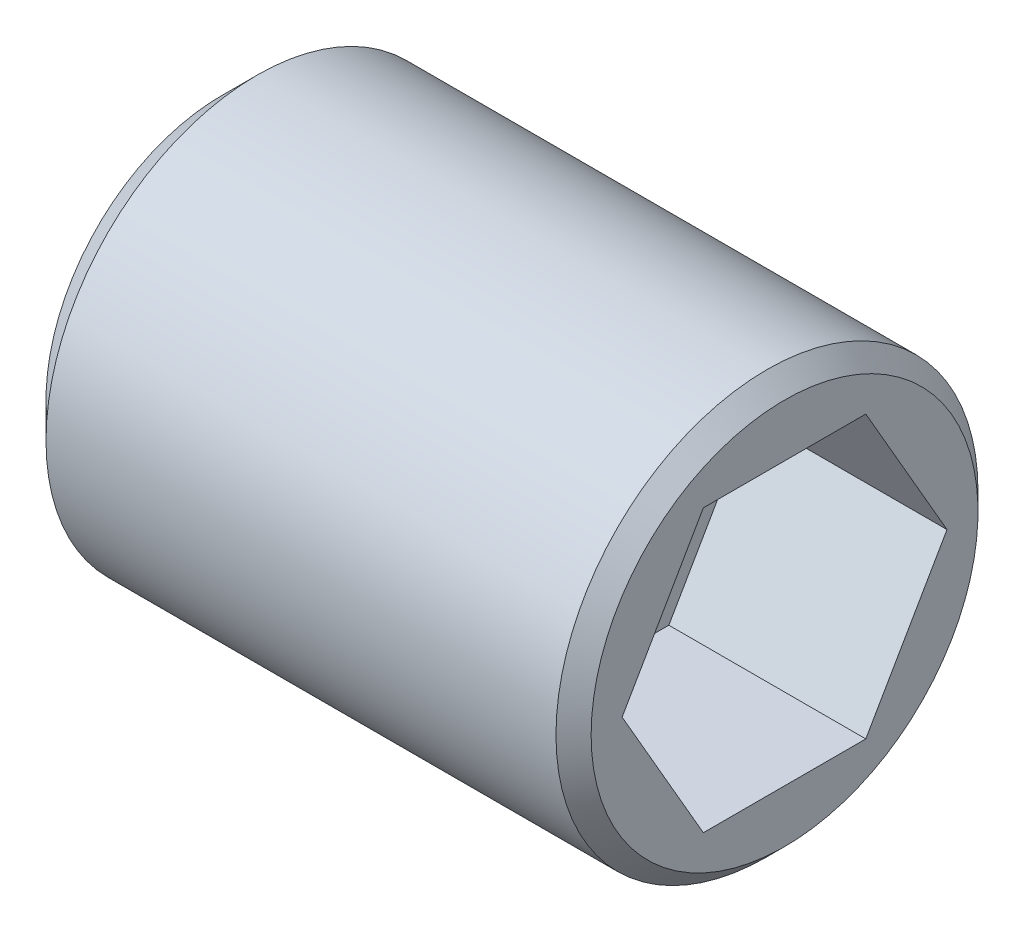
ISO-10303-21;
HEADER;
FILE_DESCRIPTION(('STEP AP214'),'2;1');
FILE_NAME('part.step','',(''),(''),'','','');
FILE_SCHEMA(('AUTOMOTIVE_DESIGN { 1 0 10303 214 1 1 1 1 }'));
ENDSEC;
DATA;
#1=APPLICATION_CONTEXT('core data for automotive mechanical design processes');
#2=APPLICATION_PROTOCOL_DEFINITION('international standard','automotive_design',2000,#1);
#3=PRODUCT_CONTEXT('',#1,'mechanical');
#4=PRODUCT('Part','Part','',(#3));
#5=PRODUCT_RELATED_PRODUCT_CATEGORY('part','',(#4));
#6=PRODUCT_DEFINITION_FORMATION('','',#4);
#7=PRODUCT_DEFINITION_CONTEXT('part definition',#1,'design');
#8=PRODUCT_DEFINITION('design','',#6,#7);
#9=PRODUCT_DEFINITION_SHAPE('','',#8);
#10=(LENGTH_UNIT() NAMED_UNIT(*) SI_UNIT(.MILLI.,.METRE.));
#11=(NAMED_UNIT(*) PLANE_ANGLE_UNIT() SI_UNIT($,.RADIAN.));
#12=(NAMED_UNIT(*) SI_UNIT($,.STERADIAN.) SOLID_ANGLE_UNIT());
#13=UNCERTAINTY_MEASURE_WITH_UNIT(LENGTH_MEASURE(1.E-05),#10,'distance_accuracy_value','');
#14=(GEOMETRIC_REPRESENTATION_CONTEXT(3) GLOBAL_UNCERTAINTY_ASSIGNED_CONTEXT((#13)) GLOBAL_UNIT_ASSIGNED_CONTEXT((#10,
#11,#12)) REPRESENTATION_CONTEXT('',''));
#15=CARTESIAN_POINT('',(0.,0.,0.));
#16=DIRECTION('',(0.,0.,1.));
#17=DIRECTION('',(1.,0.,0.));
#18=AXIS2_PLACEMENT_3D('',#15,#16,#17);
#19=CARTESIAN_POINT('',(0.,0.,0.));
#20=DIRECTION('',(1.,0.,0.));
#21=DIRECTION('',(0.,0.,-1.));
#22=AXIS2_PLACEMENT_3D('',#19,#20,#21);
#23=PLANE('',#22);
#24=CARTESIAN_POINT('',(0.,0.,0.));
#25=DIRECTION('',(1.,0.,0.));
#26=DIRECTION('',(0.,0.,-1.));
#27=AXIS2_PLACEMENT_3D('',#24,#25,#26);
#28=CIRCLE('',#27,2.5);
#29=CARTESIAN_POINT('',(0.,0.,-2.5));
#30=VERTEX_POINT('',#29);
#31=EDGE_CURVE('E133',#30,#30,#28,.F.);
#32=ORIENTED_EDGE('',*,*,#31,.T.);
#33=EDGE_LOOP('',(#32));
#34=FACE_BOUND('',#33,.T.);
#35=ADVANCED_FACE('F32',(#34),#23,.F.);
#36=CARTESIAN_POINT('',(-25.8284750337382,0.,0.));
#37=DIRECTION('',(-1.,0.,0.));
#38=DIRECTION('',(0.,0.,1.));
#39=AXIS2_PLACEMENT_3D('',#36,#37,#38);
#40=CYLINDRICAL_SURFACE('',#39,3.);
#41=CARTESIAN_POINT('',(7.75,0.,0.));
#42=DIRECTION('',(-1.,0.,0.));
#43=DIRECTION('',(0.,0.,1.));
#44=AXIS2_PLACEMENT_3D('',#41,#42,#43);
#45=CIRCLE('',#44,3.);
#46=CARTESIAN_POINT('',(7.75,0.,3.));
#47=VERTEX_POINT('',#46);
#48=EDGE_CURVE('E39',#47,#47,#45,.T.);
#49=ORIENTED_EDGE('',*,*,#48,.T.);
#50=EDGE_LOOP('',(#49));
#51=FACE_BOUND('',#50,.T.);
#52=CARTESIAN_POINT('',(0.5,0.,0.));
#53=DIRECTION('',(1.,0.,0.));
#54=DIRECTION('',(0.,0.,-1.));
#55=AXIS2_PLACEMENT_3D('',#52,#53,#54);
#56=CIRCLE('',#55,3.);
#57=CARTESIAN_POINT('',(0.5,0.,-3.));
#58=VERTEX_POINT('',#57);
#59=EDGE_CURVE('E142',#58,#58,#56,.T.);
#60=ORIENTED_EDGE('',*,*,#59,.T.);
#61=EDGE_LOOP('',(#60));
#62=FACE_BOUND('',#61,.T.);
#63=ADVANCED_FACE('F147',(#51,#62),#40,.T.);
#64=CARTESIAN_POINT('',(8.,3.,0.));
#65=DIRECTION('',(-1.,0.,0.));
#66=DIRECTION('',(0.,0.,1.));
#67=AXIS2_PLACEMENT_3D('',#64,#65,#66);
#68=PLANE('',#67);
#69=CARTESIAN_POINT('',(8.,0.,0.));
#70=DIRECTION('',(-1.,0.,0.));
#71=DIRECTION('',(0.,0.,1.));
#72=AXIS2_PLACEMENT_3D('',#69,#70,#71);
#73=CIRCLE('',#72,2.75);
#74=CARTESIAN_POINT('',(8.,0.,2.75));
#75=VERTEX_POINT('',#74);
#76=EDGE_CURVE('E11',#75,#75,#73,.F.);
#77=ORIENTED_EDGE('',*,*,#76,.T.);
#78=EDGE_LOOP('',(#77));
#79=FACE_BOUND('',#78,.T.);
#80=DIRECTION('',(0.,0.866025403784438,0.5));
#81=VECTOR('',#80,1.);
#82=CARTESIAN_POINT('',(8.,0.,-2.3094010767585));
#83=LINE('',#82,#81);
#84=CARTESIAN_POINT('',(8.,0.,-2.3094010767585));
#85=VERTEX_POINT('',#84);
#86=CARTESIAN_POINT('',(8.,2.,-1.15470053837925));
#87=VERTEX_POINT('',#86);
#88=EDGE_CURVE('E100',#85,#87,#83,.T.);
#89=ORIENTED_EDGE('',*,*,#88,.F.);
#90=DIRECTION('',(0.,0.866025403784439,-0.5));
#91=VECTOR('',#90,1.);
#92=CARTESIAN_POINT('',(8.,-2.,-1.15470053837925));
#93=LINE('',#92,#91);
#94=CARTESIAN_POINT('',(8.,-2.,-1.15470053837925));
#95=VERTEX_POINT('',#94);
#96=EDGE_CURVE('E46',#95,#85,#93,.T.);
#97=ORIENTED_EDGE('',*,*,#96,.F.);
#98=DIRECTION('',(0.,0.,-1.));
#99=VECTOR('',#98,1.);
#100=CARTESIAN_POINT('',(8.,-2.,1.15470053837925));
#101=LINE('',#100,#99);
#102=CARTESIAN_POINT('',(8.,-2.,1.15470053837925));
#103=VERTEX_POINT('',#102);
#104=EDGE_CURVE('E115',#103,#95,#101,.T.);
#105=ORIENTED_EDGE('',*,*,#104,.F.);
#106=DIRECTION('',(0.,-0.866025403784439,-0.5));
#107=VECTOR('',#106,1.);
#108=CARTESIAN_POINT('',(8.,0.,2.3094010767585));
#109=LINE('',#108,#107);
#110=CARTESIAN_POINT('',(8.,0.,2.3094010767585));
#111=VERTEX_POINT('',#110);
#112=EDGE_CURVE('E109',#111,#103,#109,.T.);
#113=ORIENTED_EDGE('',*,*,#112,.F.);
#114=DIRECTION('',(0.,-0.866025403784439,0.5));
#115=VECTOR('',#114,1.);
#116=CARTESIAN_POINT('',(8.,2.,1.15470053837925));
#117=LINE('',#116,#115);
#118=CARTESIAN_POINT('',(8.,2.,1.15470053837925));
#119=VERTEX_POINT('',#118);
#120=EDGE_CURVE('E107',#119,#111,#117,.T.);
#121=ORIENTED_EDGE('',*,*,#120,.F.);
#122=DIRECTION('',(0.,0.,1.));
#123=VECTOR('',#122,1.);
#124=CARTESIAN_POINT('',(8.,2.,-1.15470053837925));
#125=LINE('',#124,#123);
#126=EDGE_CURVE('E89',#87,#119,#125,.T.);
#127=ORIENTED_EDGE('',*,*,#126,.F.);
#128=EDGE_LOOP('',(#89,#97,#105,#113,#121,#127));
#129=FACE_BOUND('',#128,.T.);
#130=ADVANCED_FACE('F104',(#79,#129),#68,.F.);
#131=CARTESIAN_POINT('',(0.,0.,0.));
#132=DIRECTION('',(1.,0.,0.));
#133=DIRECTION('',(0.,0.,-1.));
#134=AXIS2_PLACEMENT_3D('',#131,#132,#133);
#135=CONICAL_SURFACE('',#134,2.5,0.785398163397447);
#136=ORIENTED_EDGE('',*,*,#59,.F.);
#137=EDGE_LOOP('',(#136));
#138=FACE_BOUND('',#137,.T.);
#139=ORIENTED_EDGE('',*,*,#31,.F.);
#140=EDGE_LOOP('',(#139));
#141=FACE_BOUND('',#140,.T.);
#142=ADVANCED_FACE('F168',(#138,#141),#135,.T.);
#143=CARTESIAN_POINT('',(5.2,-2.,-1.15470053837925));
#144=DIRECTION('',(0.,-0.5,-0.866025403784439));
#145=DIRECTION('',(0.,0.866025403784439,-0.5));
#146=AXIS2_PLACEMENT_3D('',#143,#144,#145);
#147=PLANE('',#146);
#148=ORIENTED_EDGE('',*,*,#96,.T.);
#149=DIRECTION('',(1.,0.,0.));
#150=VECTOR('',#149,1.);
#151=CARTESIAN_POINT('',(5.2,0.,-2.3094010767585));
#152=LINE('',#151,#150);
#153=CARTESIAN_POINT('',(5.2,0.,-2.3094010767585));
#154=VERTEX_POINT('',#153);
#155=EDGE_CURVE('E97',#154,#85,#152,.T.);
#156=ORIENTED_EDGE('',*,*,#155,.F.);
#157=DIRECTION('',(0.,0.866025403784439,-0.5));
#158=VECTOR('',#157,1.);
#159=CARTESIAN_POINT('',(5.2,-2.,-1.15470053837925));
#160=LINE('',#159,#158);
#161=CARTESIAN_POINT('',(5.2,-2.,-1.15470053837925));
#162=VERTEX_POINT('',#161);
#163=EDGE_CURVE('E117',#162,#154,#160,.T.);
#164=ORIENTED_EDGE('',*,*,#163,.F.);
#165=DIRECTION('',(1.,0.,0.));
#166=VECTOR('',#165,1.);
#167=CARTESIAN_POINT('',(5.2,-2.,-1.15470053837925));
#168=LINE('',#167,#166);
#169=EDGE_CURVE('E53',#162,#95,#168,.T.);
#170=ORIENTED_EDGE('',*,*,#169,.T.);
#171=EDGE_LOOP('',(#148,#156,#164,#170));
#172=FACE_BOUND('',#171,.T.);
#173=ADVANCED_FACE('F170',(#172),#147,.F.);
#174=CARTESIAN_POINT('',(5.2,-2.,1.15470053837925));
#175=DIRECTION('',(0.,-1.,0.));
#176=DIRECTION('',(0.,0.,-1.));
#177=AXIS2_PLACEMENT_3D('',#174,#175,#176);
#178=PLANE('',#177);
#179=ORIENTED_EDGE('',*,*,#104,.T.);
#180=ORIENTED_EDGE('',*,*,#169,.F.);
#181=DIRECTION('',(0.,0.,-1.));
#182=VECTOR('',#181,1.);
#183=CARTESIAN_POINT('',(5.2,-2.,1.15470053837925));
#184=LINE('',#183,#182);
#185=CARTESIAN_POINT('',(5.2,-2.,1.15470053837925));
#186=VERTEX_POINT('',#185);
#187=EDGE_CURVE('E129',#186,#162,#184,.T.);
#188=ORIENTED_EDGE('',*,*,#187,.F.);
#189=DIRECTION('',(1.,0.,0.));
#190=VECTOR('',#189,1.);
#191=CARTESIAN_POINT('',(5.2,-2.,1.15470053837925));
#192=LINE('',#191,#190);
#193=EDGE_CURVE('E134',#186,#103,#192,.T.);
#194=ORIENTED_EDGE('',*,*,#193,.T.);
#195=EDGE_LOOP('',(#179,#180,#188,#194));
#196=FACE_BOUND('',#195,.T.);
#197=ADVANCED_FACE('F177',(#196),#178,.F.);
#198=CARTESIAN_POINT('',(5.2,0.,2.3094010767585));
#199=DIRECTION('',(0.,-0.5,0.866025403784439));
#200=DIRECTION('',(0.,-0.866025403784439,-0.5));
#201=AXIS2_PLACEMENT_3D('',#198,#199,#200);
#202=PLANE('',#201);
#203=ORIENTED_EDGE('',*,*,#112,.T.);
#204=ORIENTED_EDGE('',*,*,#193,.F.);
#205=DIRECTION('',(0.,-0.866025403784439,-0.5));
#206=VECTOR('',#205,1.);
#207=CARTESIAN_POINT('',(5.2,0.,2.3094010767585));
#208=LINE('',#207,#206);
#209=CARTESIAN_POINT('',(5.2,0.,2.3094010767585));
#210=VERTEX_POINT('',#209);
#211=EDGE_CURVE('E126',#210,#186,#208,.T.);
#212=ORIENTED_EDGE('',*,*,#211,.F.);
#213=DIRECTION('',(1.,0.,0.));
#214=VECTOR('',#213,1.);
#215=CARTESIAN_POINT('',(5.2,0.,2.3094010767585));
#216=LINE('',#215,#214);
#217=EDGE_CURVE('E136',#210,#111,#216,.T.);
#218=ORIENTED_EDGE('',*,*,#217,.T.);
#219=EDGE_LOOP('',(#203,#204,#212,#218));
#220=FACE_BOUND('',#219,.T.);
#221=ADVANCED_FACE('F190',(#220),#202,.F.);
#222=CARTESIAN_POINT('',(5.2,2.,1.15470053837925));
#223=DIRECTION('',(0.,0.5,0.866025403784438));
#224=DIRECTION('',(0.,-0.866025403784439,0.5));
#225=AXIS2_PLACEMENT_3D('',#222,#223,#224);
#226=PLANE('',#225);
#227=ORIENTED_EDGE('',*,*,#120,.T.);
#228=ORIENTED_EDGE('',*,*,#217,.F.);
#229=DIRECTION('',(0.,-0.866025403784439,0.5));
#230=VECTOR('',#229,1.);
#231=CARTESIAN_POINT('',(5.2,2.,1.15470053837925));
#232=LINE('',#231,#230);
#233=CARTESIAN_POINT('',(5.2,2.,1.15470053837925));
#234=VERTEX_POINT('',#233);
#235=EDGE_CURVE('E123',#234,#210,#232,.T.);
#236=ORIENTED_EDGE('',*,*,#235,.F.);
#237=DIRECTION('',(1.,0.,0.));
#238=VECTOR('',#237,1.);
#239=CARTESIAN_POINT('',(5.2,2.,1.15470053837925));
#240=LINE('',#239,#238);
#241=EDGE_CURVE('E96',#234,#119,#240,.T.);
#242=ORIENTED_EDGE('',*,*,#241,.T.);
#243=EDGE_LOOP('',(#227,#228,#236,#242));
#244=FACE_BOUND('',#243,.T.);
#245=ADVANCED_FACE('F187',(#244),#226,.F.);
#246=CARTESIAN_POINT('',(5.2,2.,-1.15470053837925));
#247=DIRECTION('',(0.,1.,0.));
#248=DIRECTION('',(0.,0.,1.));
#249=AXIS2_PLACEMENT_3D('',#246,#247,#248);
#250=PLANE('',#249);
#251=ORIENTED_EDGE('',*,*,#126,.T.);
#252=ORIENTED_EDGE('',*,*,#241,.F.);
#253=DIRECTION('',(0.,0.,1.));
#254=VECTOR('',#253,1.);
#255=CARTESIAN_POINT('',(5.2,2.,-1.15470053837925));
#256=LINE('',#255,#254);
#257=CARTESIAN_POINT('',(5.2,2.,-1.15470053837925));
#258=VERTEX_POINT('',#257);
#259=EDGE_CURVE('E92',#258,#234,#256,.T.);
#260=ORIENTED_EDGE('',*,*,#259,.F.);
#261=DIRECTION('',(1.,0.,0.));
#262=VECTOR('',#261,1.);
#263=CARTESIAN_POINT('',(5.2,2.,-1.15470053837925));
#264=LINE('',#263,#262);
#265=EDGE_CURVE('E85',#258,#87,#264,.T.);
#266=ORIENTED_EDGE('',*,*,#265,.T.);
#267=EDGE_LOOP('',(#251,#252,#260,#266));
#268=FACE_BOUND('',#267,.T.);
#269=ADVANCED_FACE('F87',(#268),#250,.F.);
#270=CARTESIAN_POINT('',(5.2,0.,-2.3094010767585));
#271=DIRECTION('',(0.,0.5,-0.866025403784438));
#272=DIRECTION('',(0.,0.866025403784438,0.5));
#273=AXIS2_PLACEMENT_3D('',#270,#271,#272);
#274=PLANE('',#273);
#275=ORIENTED_EDGE('',*,*,#88,.T.);
#276=ORIENTED_EDGE('',*,*,#265,.F.);
#277=DIRECTION('',(0.,0.866025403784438,0.5));
#278=VECTOR('',#277,1.);
#279=CARTESIAN_POINT('',(5.2,0.,-2.3094010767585));
#280=LINE('',#279,#278);
#281=EDGE_CURVE('E120',#154,#258,#280,.T.);
#282=ORIENTED_EDGE('',*,*,#281,.F.);
#283=ORIENTED_EDGE('',*,*,#155,.T.);
#284=EDGE_LOOP('',(#275,#276,#282,#283));
#285=FACE_BOUND('',#284,.T.);
#286=ADVANCED_FACE('F101',(#285),#274,.F.);
#287=CARTESIAN_POINT('',(5.2,-2.,-1.15470053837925));
#288=DIRECTION('',(-1.,0.,0.));
#289=DIRECTION('',(0.,0.,1.));
#290=AXIS2_PLACEMENT_3D('',#287,#288,#289);
#291=PLANE('',#290);
#292=ORIENTED_EDGE('',*,*,#163,.T.);
#293=ORIENTED_EDGE('',*,*,#281,.T.);
#294=ORIENTED_EDGE('',*,*,#259,.T.);
#295=ORIENTED_EDGE('',*,*,#235,.T.);
#296=ORIENTED_EDGE('',*,*,#211,.T.);
#297=ORIENTED_EDGE('',*,*,#187,.T.);
#298=EDGE_LOOP('',(#292,#293,#294,#295,#296,#297));
#299=FACE_BOUND('',#298,.T.);
#300=ADVANCED_FACE('F152',(#299),#291,.F.);
#301=CARTESIAN_POINT('',(7.75,0.,0.));
#302=DIRECTION('',(-1.,0.,0.));
#303=DIRECTION('',(0.,0.,1.));
#304=AXIS2_PLACEMENT_3D('',#301,#302,#303);
#305=CONICAL_SURFACE('',#304,3.,0.785398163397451);
#306=ORIENTED_EDGE('',*,*,#76,.F.);
#307=EDGE_LOOP('',(#306));
#308=FACE_BOUND('',#307,.T.);
#309=ORIENTED_EDGE('',*,*,#48,.F.);
#310=EDGE_LOOP('',(#309));
#311=FACE_BOUND('',#310,.T.);
#312=ADVANCED_FACE('F150',(#308,#311),#305,.T.);
#313=CLOSED_SHELL('',(#35,#63,#130,#142,#173,#197,#221,#245,#269,#286,#300,#312));
#314=MANIFOLD_SOLID_BREP('B2',#313);
#315=ADVANCED_BREP_SHAPE_REPRESENTATION('',(#18,#314),#14);
#316=SHAPE_DEFINITION_REPRESENTATION(#9,#315);
ENDSEC;
END-ISO-10303-21;
